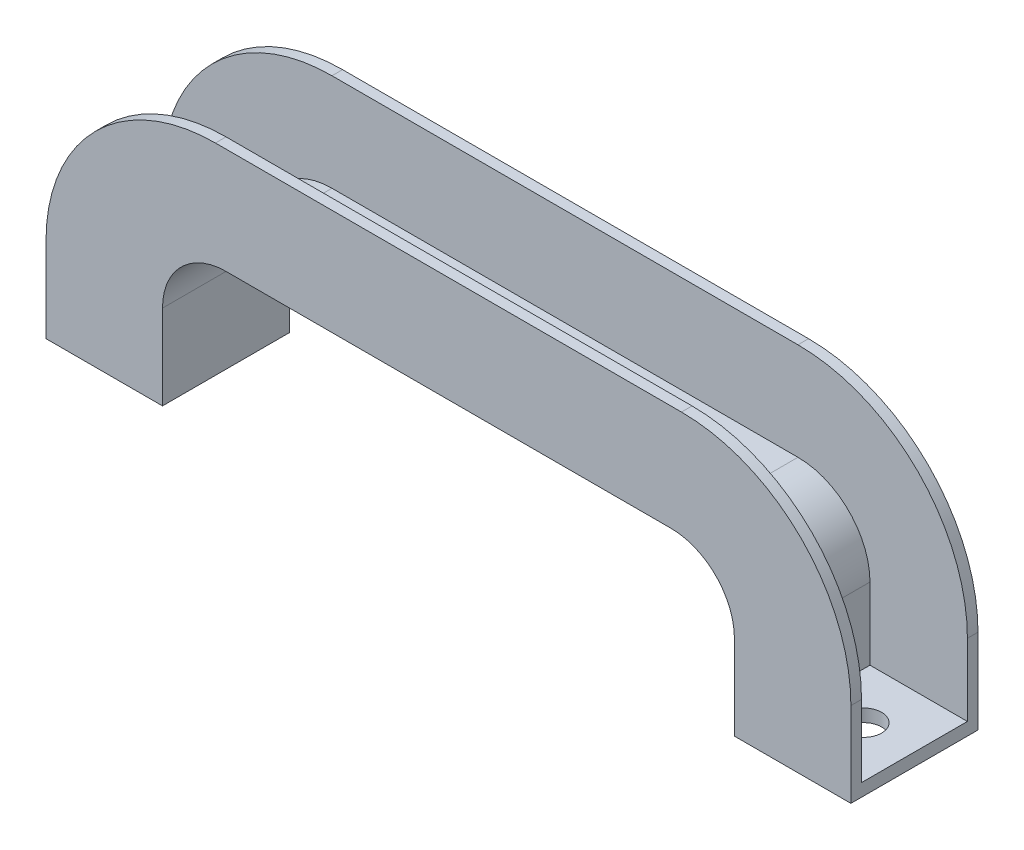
ISO-10303-21;
HEADER;
FILE_DESCRIPTION(('STEP AP214'),'2;1');
FILE_NAME('part.step','',(''),(''),'','','');
FILE_SCHEMA(('AUTOMOTIVE_DESIGN { 1 0 10303 214 1 1 1 1 }'));
ENDSEC;
DATA;
#1=APPLICATION_CONTEXT('core data for automotive mechanical design processes');
#2=APPLICATION_PROTOCOL_DEFINITION('international standard','automotive_design',2000,#1);
#3=PRODUCT_CONTEXT('',#1,'mechanical');
#4=PRODUCT('Part','Part','',(#3));
#5=PRODUCT_RELATED_PRODUCT_CATEGORY('part','',(#4));
#6=PRODUCT_DEFINITION_FORMATION('','',#4);
#7=PRODUCT_DEFINITION_CONTEXT('part definition',#1,'design');
#8=PRODUCT_DEFINITION('design','',#6,#7);
#9=PRODUCT_DEFINITION_SHAPE('','',#8);
#10=(LENGTH_UNIT() NAMED_UNIT(*) SI_UNIT(.MILLI.,.METRE.));
#11=(NAMED_UNIT(*) PLANE_ANGLE_UNIT() SI_UNIT($,.RADIAN.));
#12=(NAMED_UNIT(*) SI_UNIT($,.STERADIAN.) SOLID_ANGLE_UNIT());
#13=UNCERTAINTY_MEASURE_WITH_UNIT(LENGTH_MEASURE(1.E-05),#10,'distance_accuracy_value','');
#14=(GEOMETRIC_REPRESENTATION_CONTEXT(3) GLOBAL_UNCERTAINTY_ASSIGNED_CONTEXT((#13)) GLOBAL_UNIT_ASSIGNED_CONTEXT((#10,
#11,#12)) REPRESENTATION_CONTEXT('',''));
#15=CARTESIAN_POINT('',(0.,0.,0.));
#16=DIRECTION('',(0.,0.,1.));
#17=DIRECTION('',(1.,0.,0.));
#18=AXIS2_PLACEMENT_3D('',#15,#16,#17);
#19=CARTESIAN_POINT('',(190.,20.,15.));
#20=DIRECTION('',(-1.,0.,0.));
#21=DIRECTION('',(0.,-1.,0.));
#22=AXIS2_PLACEMENT_3D('',#19,#20,#21);
#23=PLANE('',#22);
#24=DIRECTION('',(0.,1.,0.));
#25=VECTOR('',#24,1.);
#26=CARTESIAN_POINT('',(190.,20.,-12.5));
#27=LINE('',#26,#25);
#28=CARTESIAN_POINT('',(190.,3.00000000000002,-12.5));
#29=VERTEX_POINT('',#28);
#30=CARTESIAN_POINT('',(190.,20.,-12.5));
#31=VERTEX_POINT('',#30);
#32=EDGE_CURVE('E281',#29,#31,#27,.T.);
#33=ORIENTED_EDGE('',*,*,#32,.F.);
#34=DIRECTION('',(0.,0.,1.));
#35=VECTOR('',#34,1.);
#36=CARTESIAN_POINT('',(190.,3.00000000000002,15.));
#37=LINE('',#36,#35);
#38=CARTESIAN_POINT('',(190.,3.00000000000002,12.5));
#39=VERTEX_POINT('',#38);
#40=EDGE_CURVE('E11',#29,#39,#37,.T.);
#41=ORIENTED_EDGE('',*,*,#40,.T.);
#42=DIRECTION('',(0.,1.,0.));
#43=VECTOR('',#42,1.);
#44=CARTESIAN_POINT('',(190.,20.,12.5));
#45=LINE('',#44,#43);
#46=CARTESIAN_POINT('',(190.,20.,12.5));
#47=VERTEX_POINT('',#46);
#48=EDGE_CURVE('E272',#39,#47,#45,.T.);
#49=ORIENTED_EDGE('',*,*,#48,.T.);
#50=DIRECTION('',(0.,0.,-1.));
#51=VECTOR('',#50,1.);
#52=CARTESIAN_POINT('',(190.,20.,15.));
#53=LINE('',#52,#51);
#54=CARTESIAN_POINT('',(190.,20.,15.));
#55=VERTEX_POINT('',#54);
#56=EDGE_CURVE('E351',#55,#47,#53,.T.);
#57=ORIENTED_EDGE('',*,*,#56,.F.);
#58=DIRECTION('',(0.,1.,0.));
#59=VECTOR('',#58,1.);
#60=CARTESIAN_POINT('',(190.,20.,15.));
#61=LINE('',#60,#59);
#62=CARTESIAN_POINT('',(190.,0.,15.));
#63=VERTEX_POINT('',#62);
#64=EDGE_CURVE('E326',#63,#55,#61,.T.);
#65=ORIENTED_EDGE('',*,*,#64,.F.);
#66=DIRECTION('',(0.,0.,-1.));
#67=VECTOR('',#66,1.);
#68=CARTESIAN_POINT('',(190.,0.,15.));
#69=LINE('',#68,#67);
#70=CARTESIAN_POINT('',(190.,0.,-15.));
#71=VERTEX_POINT('',#70);
#72=EDGE_CURVE('E354',#63,#71,#69,.T.);
#73=ORIENTED_EDGE('',*,*,#72,.T.);
#74=DIRECTION('',(0.,1.,0.));
#75=VECTOR('',#74,1.);
#76=CARTESIAN_POINT('',(190.,20.,-15.));
#77=LINE('',#76,#75);
#78=CARTESIAN_POINT('',(190.,20.,-15.));
#79=VERTEX_POINT('',#78);
#80=EDGE_CURVE('E298',#71,#79,#77,.T.);
#81=ORIENTED_EDGE('',*,*,#80,.T.);
#82=EDGE_CURVE('E350',#31,#79,#53,.T.);
#83=ORIENTED_EDGE('',*,*,#82,.F.);
#84=EDGE_LOOP('',(#33,#41,#49,#57,#65,#73,#81,#83));
#85=FACE_BOUND('',#84,.T.);
#86=ADVANCED_FACE('F33',(#85),#23,.F.);
#87=CARTESIAN_POINT('',(150.,20.,15.));
#88=DIRECTION('',(0.,0.,-1.));
#89=DIRECTION('',(-1.,0.,0.));
#90=AXIS2_PLACEMENT_3D('',#87,#88,#89);
#91=CYLINDRICAL_SURFACE('',#90,40.);
#92=CARTESIAN_POINT('',(150.,20.,-12.5));
#93=DIRECTION('',(0.,0.,1.));
#94=DIRECTION('',(1.,0.,0.));
#95=AXIS2_PLACEMENT_3D('',#92,#93,#94);
#96=CIRCLE('',#95,40.);
#97=CARTESIAN_POINT('',(150.,60.,-12.5));
#98=VERTEX_POINT('',#97);
#99=EDGE_CURVE('E279',#31,#98,#96,.T.);
#100=ORIENTED_EDGE('',*,*,#99,.F.);
#101=ORIENTED_EDGE('',*,*,#82,.T.);
#102=CARTESIAN_POINT('',(150.,20.,-15.));
#103=DIRECTION('',(0.,0.,1.));
#104=DIRECTION('',(-1.,0.,0.));
#105=AXIS2_PLACEMENT_3D('',#102,#103,#104);
#106=CIRCLE('',#105,40.);
#107=CARTESIAN_POINT('',(150.,60.,-15.));
#108=VERTEX_POINT('',#107);
#109=EDGE_CURVE('E301',#79,#108,#106,.T.);
#110=ORIENTED_EDGE('',*,*,#109,.T.);
#111=DIRECTION('',(0.,0.,-1.));
#112=VECTOR('',#111,1.);
#113=CARTESIAN_POINT('',(150.,60.,15.));
#114=LINE('',#113,#112);
#115=EDGE_CURVE('E346',#98,#108,#114,.T.);
#116=ORIENTED_EDGE('',*,*,#115,.F.);
#117=EDGE_LOOP('',(#100,#101,#110,#116));
#118=FACE_BOUND('',#117,.T.);
#119=ADVANCED_FACE('F420',(#118),#91,.T.);
#120=CARTESIAN_POINT('',(40.,60.,15.));
#121=DIRECTION('',(0.,-1.,0.));
#122=DIRECTION('',(1.,0.,0.));
#123=AXIS2_PLACEMENT_3D('',#120,#121,#122);
#124=PLANE('',#123);
#125=DIRECTION('',(-1.,0.,0.));
#126=VECTOR('',#125,1.);
#127=CARTESIAN_POINT('',(40.,60.,-12.5));
#128=LINE('',#127,#126);
#129=CARTESIAN_POINT('',(40.,60.,-12.5));
#130=VERTEX_POINT('',#129);
#131=EDGE_CURVE('E277',#98,#130,#128,.T.);
#132=ORIENTED_EDGE('',*,*,#131,.F.);
#133=ORIENTED_EDGE('',*,*,#115,.T.);
#134=DIRECTION('',(-1.,0.,0.));
#135=VECTOR('',#134,1.);
#136=CARTESIAN_POINT('',(40.,60.,-15.));
#137=LINE('',#136,#135);
#138=CARTESIAN_POINT('',(40.,60.,-15.));
#139=VERTEX_POINT('',#138);
#140=EDGE_CURVE('E304',#108,#139,#137,.T.);
#141=ORIENTED_EDGE('',*,*,#140,.T.);
#142=DIRECTION('',(0.,0.,-1.));
#143=VECTOR('',#142,1.);
#144=CARTESIAN_POINT('',(40.,60.,15.));
#145=LINE('',#144,#143);
#146=EDGE_CURVE('E342',#130,#139,#145,.T.);
#147=ORIENTED_EDGE('',*,*,#146,.F.);
#148=EDGE_LOOP('',(#132,#133,#141,#147));
#149=FACE_BOUND('',#148,.T.);
#150=ADVANCED_FACE('F486',(#149),#124,.F.);
#151=CARTESIAN_POINT('',(40.,20.,15.));
#152=DIRECTION('',(0.,0.,-1.));
#153=DIRECTION('',(-1.,0.,0.));
#154=AXIS2_PLACEMENT_3D('',#151,#152,#153);
#155=CYLINDRICAL_SURFACE('',#154,40.);
#156=CARTESIAN_POINT('',(40.,20.,-12.5));
#157=DIRECTION('',(0.,0.,1.));
#158=DIRECTION('',(1.,0.,0.));
#159=AXIS2_PLACEMENT_3D('',#156,#157,#158);
#160=CIRCLE('',#159,40.);
#161=CARTESIAN_POINT('',(0.,20.,-12.5));
#162=VERTEX_POINT('',#161);
#163=EDGE_CURVE('E275',#130,#162,#160,.T.);
#164=ORIENTED_EDGE('',*,*,#163,.F.);
#165=ORIENTED_EDGE('',*,*,#146,.T.);
#166=CARTESIAN_POINT('',(40.,20.,-15.));
#167=DIRECTION('',(0.,0.,1.));
#168=DIRECTION('',(-1.,0.,0.));
#169=AXIS2_PLACEMENT_3D('',#166,#167,#168);
#170=CIRCLE('',#169,40.);
#171=CARTESIAN_POINT('',(0.,20.,-15.));
#172=VERTEX_POINT('',#171);
#173=EDGE_CURVE('E307',#139,#172,#170,.T.);
#174=ORIENTED_EDGE('',*,*,#173,.T.);
#175=DIRECTION('',(0.,0.,-1.));
#176=VECTOR('',#175,1.);
#177=CARTESIAN_POINT('',(0.,20.,15.));
#178=LINE('',#177,#176);
#179=EDGE_CURVE('E338',#162,#172,#178,.T.);
#180=ORIENTED_EDGE('',*,*,#179,.F.);
#181=EDGE_LOOP('',(#164,#165,#174,#180));
#182=FACE_BOUND('',#181,.T.);
#183=ADVANCED_FACE('F483',(#182),#155,.T.);
#184=CARTESIAN_POINT('',(0.,0.,15.));
#185=DIRECTION('',(1.,0.,0.));
#186=DIRECTION('',(0.,0.,-1.));
#187=AXIS2_PLACEMENT_3D('',#184,#185,#186);
#188=PLANE('',#187);
#189=DIRECTION('',(0.,-1.,0.));
#190=VECTOR('',#189,1.);
#191=CARTESIAN_POINT('',(0.,0.,-12.5));
#192=LINE('',#191,#190);
#193=CARTESIAN_POINT('',(0.,3.,-12.5));
#194=VERTEX_POINT('',#193);
#195=EDGE_CURVE('E42',#162,#194,#192,.T.);
#196=ORIENTED_EDGE('',*,*,#195,.F.);
#197=ORIENTED_EDGE('',*,*,#179,.T.);
#198=DIRECTION('',(0.,-1.,0.));
#199=VECTOR('',#198,1.);
#200=CARTESIAN_POINT('',(0.,0.,-15.));
#201=LINE('',#200,#199);
#202=CARTESIAN_POINT('',(0.,0.,-15.));
#203=VERTEX_POINT('',#202);
#204=EDGE_CURVE('E310',#172,#203,#201,.T.);
#205=ORIENTED_EDGE('',*,*,#204,.T.);
#206=DIRECTION('',(0.,0.,-1.));
#207=VECTOR('',#206,1.);
#208=CARTESIAN_POINT('',(0.,0.,15.));
#209=LINE('',#208,#207);
#210=CARTESIAN_POINT('',(0.,0.,15.));
#211=VERTEX_POINT('',#210);
#212=EDGE_CURVE('E335',#211,#203,#209,.T.);
#213=ORIENTED_EDGE('',*,*,#212,.F.);
#214=DIRECTION('',(0.,-1.,0.));
#215=VECTOR('',#214,1.);
#216=CARTESIAN_POINT('',(0.,0.,15.));
#217=LINE('',#216,#215);
#218=CARTESIAN_POINT('',(0.,20.,15.));
#219=VERTEX_POINT('',#218);
#220=EDGE_CURVE('E58',#219,#211,#217,.T.);
#221=ORIENTED_EDGE('',*,*,#220,.F.);
#222=CARTESIAN_POINT('',(0.,20.,12.5));
#223=VERTEX_POINT('',#222);
#224=EDGE_CURVE('E339',#219,#223,#178,.T.);
#225=ORIENTED_EDGE('',*,*,#224,.T.);
#226=DIRECTION('',(0.,-1.,0.));
#227=VECTOR('',#226,1.);
#228=CARTESIAN_POINT('',(0.,0.,12.5));
#229=LINE('',#228,#227);
#230=CARTESIAN_POINT('',(0.,2.99999999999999,12.5));
#231=VERTEX_POINT('',#230);
#232=EDGE_CURVE('E375',#223,#231,#229,.T.);
#233=ORIENTED_EDGE('',*,*,#232,.T.);
#234=DIRECTION('',(0.,0.,-1.));
#235=VECTOR('',#234,1.);
#236=CARTESIAN_POINT('',(0.,3.,15.));
#237=LINE('',#236,#235);
#238=EDGE_CURVE('E202',#231,#194,#237,.T.);
#239=ORIENTED_EDGE('',*,*,#238,.T.);
#240=EDGE_LOOP('',(#196,#197,#205,#213,#221,#225,#233,#239));
#241=FACE_BOUND('',#240,.T.);
#242=ADVANCED_FACE('F443',(#241),#188,.F.);
#243=CARTESIAN_POINT('',(27.5,0.,15.));
#244=DIRECTION('',(0.,1.,0.));
#245=DIRECTION('',(0.,0.,1.));
#246=AXIS2_PLACEMENT_3D('',#243,#244,#245);
#247=PLANE('',#246);
#248=CARTESIAN_POINT('',(12.,0.,0.));
#249=DIRECTION('',(0.,-1.,0.));
#250=DIRECTION('',(0.,0.,-1.));
#251=AXIS2_PLACEMENT_3D('',#248,#249,#250);
#252=CIRCLE('',#251,4.25);
#253=CARTESIAN_POINT('',(12.,0.,-4.25));
#254=VERTEX_POINT('',#253);
#255=EDGE_CURVE('E379',#254,#254,#252,.T.);
#256=ORIENTED_EDGE('',*,*,#255,.F.);
#257=EDGE_LOOP('',(#256));
#258=FACE_BOUND('',#257,.T.);
#259=DIRECTION('',(1.,0.,0.));
#260=VECTOR('',#259,1.);
#261=CARTESIAN_POINT('',(27.5,0.,-15.));
#262=LINE('',#261,#260);
#263=CARTESIAN_POINT('',(27.5,0.,-15.));
#264=VERTEX_POINT('',#263);
#265=EDGE_CURVE('E283',#203,#264,#262,.T.);
#266=ORIENTED_EDGE('',*,*,#265,.T.);
#267=DIRECTION('',(0.,0.,-1.));
#268=VECTOR('',#267,1.);
#269=CARTESIAN_POINT('',(27.5,0.,15.));
#270=LINE('',#269,#268);
#271=CARTESIAN_POINT('',(27.5,0.,15.));
#272=VERTEX_POINT('',#271);
#273=EDGE_CURVE('E372',#272,#264,#270,.T.);
#274=ORIENTED_EDGE('',*,*,#273,.F.);
#275=DIRECTION('',(1.,0.,0.));
#276=VECTOR('',#275,1.);
#277=CARTESIAN_POINT('',(27.5,0.,15.));
#278=LINE('',#277,#276);
#279=EDGE_CURVE('E312',#211,#272,#278,.T.);
#280=ORIENTED_EDGE('',*,*,#279,.F.);
#281=ORIENTED_EDGE('',*,*,#212,.T.);
#282=EDGE_LOOP('',(#266,#274,#280,#281));
#283=FACE_BOUND('',#282,.T.);
#284=ADVANCED_FACE('F35',(#258,#283),#247,.F.);
#285=CARTESIAN_POINT('',(27.5,20.,15.));
#286=DIRECTION('',(-1.,0.,0.));
#287=DIRECTION('',(0.,0.,1.));
#288=AXIS2_PLACEMENT_3D('',#285,#286,#287);
#289=PLANE('',#288);
#290=DIRECTION('',(0.,1.,0.));
#291=VECTOR('',#290,1.);
#292=CARTESIAN_POINT('',(27.5,20.,-15.));
#293=LINE('',#292,#291);
#294=CARTESIAN_POINT('',(27.5,20.,-15.));
#295=VERTEX_POINT('',#294);
#296=EDGE_CURVE('E286',#264,#295,#293,.T.);
#297=ORIENTED_EDGE('',*,*,#296,.T.);
#298=DIRECTION('',(0.,0.,-1.));
#299=VECTOR('',#298,1.);
#300=CARTESIAN_POINT('',(27.5,20.,15.));
#301=LINE('',#300,#299);
#302=CARTESIAN_POINT('',(27.5,20.,15.));
#303=VERTEX_POINT('',#302);
#304=EDGE_CURVE('E369',#303,#295,#301,.T.);
#305=ORIENTED_EDGE('',*,*,#304,.F.);
#306=DIRECTION('',(0.,1.,0.));
#307=VECTOR('',#306,1.);
#308=CARTESIAN_POINT('',(27.5,20.,15.));
#309=LINE('',#308,#307);
#310=EDGE_CURVE('E314',#272,#303,#309,.T.);
#311=ORIENTED_EDGE('',*,*,#310,.F.);
#312=ORIENTED_EDGE('',*,*,#273,.T.);
#313=EDGE_LOOP('',(#297,#305,#311,#312));
#314=FACE_BOUND('',#313,.T.);
#315=ADVANCED_FACE('F478',(#314),#289,.F.);
#316=CARTESIAN_POINT('',(42.5,20.,15.));
#317=DIRECTION('',(0.,0.,-1.));
#318=DIRECTION('',(-1.,0.,0.));
#319=AXIS2_PLACEMENT_3D('',#316,#317,#318);
#320=CYLINDRICAL_SURFACE('',#319,15.);
#321=CARTESIAN_POINT('',(42.5,20.,-15.));
#322=DIRECTION('',(0.,0.,-1.));
#323=DIRECTION('',(1.,0.,0.));
#324=AXIS2_PLACEMENT_3D('',#321,#322,#323);
#325=CIRCLE('',#324,15.);
#326=CARTESIAN_POINT('',(42.5,35.,-15.));
#327=VERTEX_POINT('',#326);
#328=EDGE_CURVE('E288',#295,#327,#325,.T.);
#329=ORIENTED_EDGE('',*,*,#328,.T.);
#330=DIRECTION('',(0.,0.,-1.));
#331=VECTOR('',#330,1.);
#332=CARTESIAN_POINT('',(42.5,35.,15.));
#333=LINE('',#332,#331);
#334=CARTESIAN_POINT('',(42.5,35.,15.));
#335=VERTEX_POINT('',#334);
#336=EDGE_CURVE('E366',#335,#327,#333,.T.);
#337=ORIENTED_EDGE('',*,*,#336,.F.);
#338=CARTESIAN_POINT('',(42.5,20.,15.));
#339=DIRECTION('',(0.,0.,-1.));
#340=DIRECTION('',(1.,0.,0.));
#341=AXIS2_PLACEMENT_3D('',#338,#339,#340);
#342=CIRCLE('',#341,15.);
#343=EDGE_CURVE('E316',#303,#335,#342,.T.);
#344=ORIENTED_EDGE('',*,*,#343,.F.);
#345=ORIENTED_EDGE('',*,*,#304,.T.);
#346=EDGE_LOOP('',(#329,#337,#344,#345));
#347=FACE_BOUND('',#346,.T.);
#348=ADVANCED_FACE('F473',(#347),#320,.F.);
#349=CARTESIAN_POINT('',(147.5,35.,15.));
#350=DIRECTION('',(0.,1.,0.));
#351=DIRECTION('',(-1.,0.,0.));
#352=AXIS2_PLACEMENT_3D('',#349,#350,#351);
#353=PLANE('',#352);
#354=DIRECTION('',(1.,0.,0.));
#355=VECTOR('',#354,1.);
#356=CARTESIAN_POINT('',(147.5,35.,-15.));
#357=LINE('',#356,#355);
#358=CARTESIAN_POINT('',(147.5,35.,-15.));
#359=VERTEX_POINT('',#358);
#360=EDGE_CURVE('E290',#327,#359,#357,.T.);
#361=ORIENTED_EDGE('',*,*,#360,.T.);
#362=DIRECTION('',(0.,0.,-1.));
#363=VECTOR('',#362,1.);
#364=CARTESIAN_POINT('',(147.5,35.,15.));
#365=LINE('',#364,#363);
#366=CARTESIAN_POINT('',(147.5,35.,15.));
#367=VERTEX_POINT('',#366);
#368=EDGE_CURVE('E363',#367,#359,#365,.T.);
#369=ORIENTED_EDGE('',*,*,#368,.F.);
#370=DIRECTION('',(1.,0.,0.));
#371=VECTOR('',#370,1.);
#372=CARTESIAN_POINT('',(147.5,35.,15.));
#373=LINE('',#372,#371);
#374=EDGE_CURVE('E318',#335,#367,#373,.T.);
#375=ORIENTED_EDGE('',*,*,#374,.F.);
#376=ORIENTED_EDGE('',*,*,#336,.T.);
#377=EDGE_LOOP('',(#361,#369,#375,#376));
#378=FACE_BOUND('',#377,.T.);
#379=ADVANCED_FACE('F469',(#378),#353,.F.);
#380=CARTESIAN_POINT('',(147.5,20.,15.));
#381=DIRECTION('',(0.,0.,-1.));
#382=DIRECTION('',(-1.,0.,0.));
#383=AXIS2_PLACEMENT_3D('',#380,#381,#382);
#384=CYLINDRICAL_SURFACE('',#383,15.);
#385=CARTESIAN_POINT('',(147.5,20.,-15.));
#386=DIRECTION('',(0.,0.,-1.));
#387=DIRECTION('',(1.,0.,0.));
#388=AXIS2_PLACEMENT_3D('',#385,#386,#387);
#389=CIRCLE('',#388,15.);
#390=CARTESIAN_POINT('',(162.5,20.,-15.));
#391=VERTEX_POINT('',#390);
#392=EDGE_CURVE('E292',#359,#391,#389,.T.);
#393=ORIENTED_EDGE('',*,*,#392,.T.);
#394=DIRECTION('',(0.,0.,-1.));
#395=VECTOR('',#394,1.);
#396=CARTESIAN_POINT('',(162.5,20.,15.));
#397=LINE('',#396,#395);
#398=CARTESIAN_POINT('',(162.5,20.,15.));
#399=VERTEX_POINT('',#398);
#400=EDGE_CURVE('E360',#399,#391,#397,.T.);
#401=ORIENTED_EDGE('',*,*,#400,.F.);
#402=CARTESIAN_POINT('',(147.5,20.,15.));
#403=DIRECTION('',(0.,0.,-1.));
#404=DIRECTION('',(1.,0.,0.));
#405=AXIS2_PLACEMENT_3D('',#402,#403,#404);
#406=CIRCLE('',#405,15.);
#407=EDGE_CURVE('E320',#367,#399,#406,.T.);
#408=ORIENTED_EDGE('',*,*,#407,.F.);
#409=ORIENTED_EDGE('',*,*,#368,.T.);
#410=EDGE_LOOP('',(#393,#401,#408,#409));
#411=FACE_BOUND('',#410,.T.);
#412=ADVANCED_FACE('F465',(#411),#384,.F.);
#413=CARTESIAN_POINT('',(162.5,0.,15.));
#414=DIRECTION('',(1.,0.,0.));
#415=DIRECTION('',(0.,1.,0.));
#416=AXIS2_PLACEMENT_3D('',#413,#414,#415);
#417=PLANE('',#416);
#418=DIRECTION('',(0.,-1.,0.));
#419=VECTOR('',#418,1.);
#420=CARTESIAN_POINT('',(162.5,0.,-15.));
#421=LINE('',#420,#419);
#422=CARTESIAN_POINT('',(162.5,0.,-15.));
#423=VERTEX_POINT('',#422);
#424=EDGE_CURVE('E294',#391,#423,#421,.T.);
#425=ORIENTED_EDGE('',*,*,#424,.T.);
#426=DIRECTION('',(0.,0.,-1.));
#427=VECTOR('',#426,1.);
#428=CARTESIAN_POINT('',(162.5,0.,15.));
#429=LINE('',#428,#427);
#430=CARTESIAN_POINT('',(162.5,0.,15.));
#431=VERTEX_POINT('',#430);
#432=EDGE_CURVE('E357',#431,#423,#429,.T.);
#433=ORIENTED_EDGE('',*,*,#432,.F.);
#434=DIRECTION('',(0.,-1.,0.));
#435=VECTOR('',#434,1.);
#436=CARTESIAN_POINT('',(162.5,0.,15.));
#437=LINE('',#436,#435);
#438=EDGE_CURVE('E322',#399,#431,#437,.T.);
#439=ORIENTED_EDGE('',*,*,#438,.F.);
#440=ORIENTED_EDGE('',*,*,#400,.T.);
#441=EDGE_LOOP('',(#425,#433,#439,#440));
#442=FACE_BOUND('',#441,.T.);
#443=ADVANCED_FACE('F398',(#442),#417,.F.);
#444=CARTESIAN_POINT('',(190.,0.,15.));
#445=DIRECTION('',(0.,1.,0.));
#446=DIRECTION('',(0.,0.,1.));
#447=AXIS2_PLACEMENT_3D('',#444,#445,#446);
#448=PLANE('',#447);
#449=CARTESIAN_POINT('',(178.,0.,0.));
#450=DIRECTION('',(0.,-1.,0.));
#451=DIRECTION('',(0.,0.,-1.));
#452=AXIS2_PLACEMENT_3D('',#449,#450,#451);
#453=CIRCLE('',#452,4.25000000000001);
#454=CARTESIAN_POINT('',(178.,0.,-4.25000000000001));
#455=VERTEX_POINT('',#454);
#456=EDGE_CURVE('E386',#455,#455,#453,.T.);
#457=ORIENTED_EDGE('',*,*,#456,.F.);
#458=EDGE_LOOP('',(#457));
#459=FACE_BOUND('',#458,.T.);
#460=DIRECTION('',(1.,0.,0.));
#461=VECTOR('',#460,1.);
#462=CARTESIAN_POINT('',(190.,0.,-15.));
#463=LINE('',#462,#461);
#464=EDGE_CURVE('E296',#423,#71,#463,.T.);
#465=ORIENTED_EDGE('',*,*,#464,.T.);
#466=ORIENTED_EDGE('',*,*,#72,.F.);
#467=DIRECTION('',(1.,0.,0.));
#468=VECTOR('',#467,1.);
#469=CARTESIAN_POINT('',(190.,0.,15.));
#470=LINE('',#469,#468);
#471=EDGE_CURVE('E324',#431,#63,#470,.T.);
#472=ORIENTED_EDGE('',*,*,#471,.F.);
#473=ORIENTED_EDGE('',*,*,#432,.T.);
#474=EDGE_LOOP('',(#465,#466,#472,#473));
#475=FACE_BOUND('',#474,.T.);
#476=ADVANCED_FACE('F394',(#459,#475),#448,.F.);
#477=ORIENTED_EDGE('',*,*,#56,.T.);
#478=CARTESIAN_POINT('',(150.,20.,12.5));
#479=DIRECTION('',(0.,0.,1.));
#480=DIRECTION('',(1.,0.,0.));
#481=AXIS2_PLACEMENT_3D('',#478,#479,#480);
#482=CIRCLE('',#481,40.);
#483=CARTESIAN_POINT('',(150.,60.,12.5));
#484=VERTEX_POINT('',#483);
#485=EDGE_CURVE('E269',#47,#484,#482,.T.);
#486=ORIENTED_EDGE('',*,*,#485,.T.);
#487=CARTESIAN_POINT('',(150.,60.,15.));
#488=VERTEX_POINT('',#487);
#489=EDGE_CURVE('E347',#488,#484,#114,.T.);
#490=ORIENTED_EDGE('',*,*,#489,.F.);
#491=CARTESIAN_POINT('',(150.,20.,15.));
#492=DIRECTION('',(0.,0.,1.));
#493=DIRECTION('',(-1.,0.,0.));
#494=AXIS2_PLACEMENT_3D('',#491,#492,#493);
#495=CIRCLE('',#494,40.);
#496=EDGE_CURVE('E328',#55,#488,#495,.T.);
#497=ORIENTED_EDGE('',*,*,#496,.F.);
#498=EDGE_LOOP('',(#477,#486,#490,#497));
#499=FACE_BOUND('',#498,.T.);
#500=ADVANCED_FACE('F397',(#499),#91,.T.);
#501=ORIENTED_EDGE('',*,*,#489,.T.);
#502=DIRECTION('',(-1.,0.,0.));
#503=VECTOR('',#502,1.);
#504=CARTESIAN_POINT('',(40.,60.,12.5));
#505=LINE('',#504,#503);
#506=CARTESIAN_POINT('',(40.,60.,12.5));
#507=VERTEX_POINT('',#506);
#508=EDGE_CURVE('E266',#484,#507,#505,.T.);
#509=ORIENTED_EDGE('',*,*,#508,.T.);
#510=CARTESIAN_POINT('',(40.,60.,15.));
#511=VERTEX_POINT('',#510);
#512=EDGE_CURVE('E343',#511,#507,#145,.T.);
#513=ORIENTED_EDGE('',*,*,#512,.F.);
#514=DIRECTION('',(-1.,0.,0.));
#515=VECTOR('',#514,1.);
#516=CARTESIAN_POINT('',(40.,60.,15.));
#517=LINE('',#516,#515);
#518=EDGE_CURVE('E330',#488,#511,#517,.T.);
#519=ORIENTED_EDGE('',*,*,#518,.F.);
#520=EDGE_LOOP('',(#501,#509,#513,#519));
#521=FACE_BOUND('',#520,.T.);
#522=ADVANCED_FACE('F452',(#521),#124,.F.);
#523=ORIENTED_EDGE('',*,*,#512,.T.);
#524=CARTESIAN_POINT('',(40.,20.,12.5));
#525=DIRECTION('',(0.,0.,1.));
#526=DIRECTION('',(1.,0.,0.));
#527=AXIS2_PLACEMENT_3D('',#524,#525,#526);
#528=CIRCLE('',#527,40.);
#529=EDGE_CURVE('E256',#507,#223,#528,.T.);
#530=ORIENTED_EDGE('',*,*,#529,.T.);
#531=ORIENTED_EDGE('',*,*,#224,.F.);
#532=CARTESIAN_POINT('',(40.,20.,15.));
#533=DIRECTION('',(0.,0.,1.));
#534=DIRECTION('',(-1.,0.,0.));
#535=AXIS2_PLACEMENT_3D('',#532,#533,#534);
#536=CIRCLE('',#535,40.);
#537=EDGE_CURVE('E332',#511,#219,#536,.T.);
#538=ORIENTED_EDGE('',*,*,#537,.F.);
#539=EDGE_LOOP('',(#523,#530,#531,#538));
#540=FACE_BOUND('',#539,.T.);
#541=ADVANCED_FACE('F447',(#540),#155,.T.);
#542=CARTESIAN_POINT('',(40.,20.,15.));
#543=DIRECTION('',(0.,0.,-1.));
#544=DIRECTION('',(-1.,0.,0.));
#545=AXIS2_PLACEMENT_3D('',#542,#543,#544);
#546=PLANE('',#545);
#547=ORIENTED_EDGE('',*,*,#279,.T.);
#548=ORIENTED_EDGE('',*,*,#310,.T.);
#549=ORIENTED_EDGE('',*,*,#343,.T.);
#550=ORIENTED_EDGE('',*,*,#374,.T.);
#551=ORIENTED_EDGE('',*,*,#407,.T.);
#552=ORIENTED_EDGE('',*,*,#438,.T.);
#553=ORIENTED_EDGE('',*,*,#471,.T.);
#554=ORIENTED_EDGE('',*,*,#64,.T.);
#555=ORIENTED_EDGE('',*,*,#496,.T.);
#556=ORIENTED_EDGE('',*,*,#518,.T.);
#557=ORIENTED_EDGE('',*,*,#537,.T.);
#558=ORIENTED_EDGE('',*,*,#220,.T.);
#559=EDGE_LOOP('',(#547,#548,#549,#550,#551,#552,#553,#554,#555,#556,#557,#558));
#560=FACE_BOUND('',#559,.T.);
#561=ADVANCED_FACE('F456',(#560),#546,.F.);
#562=CARTESIAN_POINT('',(40.,20.,-15.));
#563=DIRECTION('',(0.,0.,-1.));
#564=DIRECTION('',(-1.,0.,0.));
#565=AXIS2_PLACEMENT_3D('',#562,#563,#564);
#566=PLANE('',#565);
#567=ORIENTED_EDGE('',*,*,#265,.F.);
#568=ORIENTED_EDGE('',*,*,#204,.F.);
#569=ORIENTED_EDGE('',*,*,#173,.F.);
#570=ORIENTED_EDGE('',*,*,#140,.F.);
#571=ORIENTED_EDGE('',*,*,#109,.F.);
#572=ORIENTED_EDGE('',*,*,#80,.F.);
#573=ORIENTED_EDGE('',*,*,#464,.F.);
#574=ORIENTED_EDGE('',*,*,#424,.F.);
#575=ORIENTED_EDGE('',*,*,#392,.F.);
#576=ORIENTED_EDGE('',*,*,#360,.F.);
#577=ORIENTED_EDGE('',*,*,#328,.F.);
#578=ORIENTED_EDGE('',*,*,#296,.F.);
#579=EDGE_LOOP('',(#567,#568,#569,#570,#571,#572,#573,#574,#575,#576,#577,#578));
#580=FACE_BOUND('',#579,.T.);
#581=ADVANCED_FACE('F414',(#580),#566,.T.);
#582=CARTESIAN_POINT('',(209.647037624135,3.00000000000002,-12.5));
#583=DIRECTION('',(0.,-1.,0.));
#584=DIRECTION('',(1.,0.,0.));
#585=AXIS2_PLACEMENT_3D('',#582,#583,#584);
#586=PLANE('',#585);
#587=CARTESIAN_POINT('',(178.,3.00000000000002,0.));
#588=DIRECTION('',(0.,-1.,0.));
#589=DIRECTION('',(1.,0.,0.));
#590=AXIS2_PLACEMENT_3D('',#587,#588,#589);
#591=CIRCLE('',#590,4.25000000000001);
#592=CARTESIAN_POINT('',(182.25,3.00000000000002,0.));
#593=VERTEX_POINT('',#592);
#594=EDGE_CURVE('E37',#593,#593,#591,.T.);
#595=ORIENTED_EDGE('',*,*,#594,.T.);
#596=EDGE_LOOP('',(#595));
#597=FACE_BOUND('',#596,.T.);
#598=DIRECTION('',(1.,0.,0.));
#599=VECTOR('',#598,1.);
#600=CARTESIAN_POINT('',(209.647037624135,3.00000000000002,-12.5));
#601=LINE('',#600,#599);
#602=CARTESIAN_POINT('',(167.,3.00000000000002,-12.5));
#603=VERTEX_POINT('',#602);
#604=EDGE_CURVE('E213',#603,#29,#601,.T.);
#605=ORIENTED_EDGE('',*,*,#604,.F.);
#606=DIRECTION('',(0.,0.,1.));
#607=VECTOR('',#606,1.);
#608=CARTESIAN_POINT('',(167.,3.00000000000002,-12.5));
#609=LINE('',#608,#607);
#610=CARTESIAN_POINT('',(167.,3.00000000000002,12.5));
#611=VERTEX_POINT('',#610);
#612=EDGE_CURVE('E254',#603,#611,#609,.T.);
#613=ORIENTED_EDGE('',*,*,#612,.T.);
#614=DIRECTION('',(1.,0.,0.));
#615=VECTOR('',#614,1.);
#616=CARTESIAN_POINT('',(209.647037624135,3.00000000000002,12.5));
#617=LINE('',#616,#615);
#618=EDGE_CURVE('E234',#611,#39,#617,.T.);
#619=ORIENTED_EDGE('',*,*,#618,.T.);
#620=ORIENTED_EDGE('',*,*,#40,.F.);
#621=EDGE_LOOP('',(#605,#613,#619,#620));
#622=FACE_BOUND('',#621,.T.);
#623=ADVANCED_FACE('F427',(#597,#622),#586,.F.);
#624=CARTESIAN_POINT('',(23.,3.,-12.5));
#625=DIRECTION('',(0.,-1.,0.));
#626=DIRECTION('',(1.,0.,0.));
#627=AXIS2_PLACEMENT_3D('',#624,#625,#626);
#628=PLANE('',#627);
#629=CARTESIAN_POINT('',(12.,3.,0.));
#630=DIRECTION('',(0.,-1.,0.));
#631=DIRECTION('',(1.,0.,0.));
#632=AXIS2_PLACEMENT_3D('',#629,#630,#631);
#633=CIRCLE('',#632,4.25);
#634=CARTESIAN_POINT('',(16.25,3.,0.));
#635=VERTEX_POINT('',#634);
#636=EDGE_CURVE('E205',#635,#635,#633,.T.);
#637=ORIENTED_EDGE('',*,*,#636,.T.);
#638=EDGE_LOOP('',(#637));
#639=FACE_BOUND('',#638,.T.);
#640=DIRECTION('',(1.,0.,0.));
#641=VECTOR('',#640,1.);
#642=CARTESIAN_POINT('',(23.,3.,12.5));
#643=LINE('',#642,#641);
#644=CARTESIAN_POINT('',(23.,3.,12.5));
#645=VERTEX_POINT('',#644);
#646=EDGE_CURVE('E50',#231,#645,#643,.T.);
#647=ORIENTED_EDGE('',*,*,#646,.T.);
#648=DIRECTION('',(0.,0.,1.));
#649=VECTOR('',#648,1.);
#650=CARTESIAN_POINT('',(23.,3.,-12.5));
#651=LINE('',#650,#649);
#652=CARTESIAN_POINT('',(23.,3.,-12.5));
#653=VERTEX_POINT('',#652);
#654=EDGE_CURVE('E199',#653,#645,#651,.T.);
#655=ORIENTED_EDGE('',*,*,#654,.F.);
#656=DIRECTION('',(1.,0.,0.));
#657=VECTOR('',#656,1.);
#658=CARTESIAN_POINT('',(23.,3.,-12.5));
#659=LINE('',#658,#657);
#660=EDGE_CURVE('E237',#194,#653,#659,.T.);
#661=ORIENTED_EDGE('',*,*,#660,.F.);
#662=ORIENTED_EDGE('',*,*,#238,.F.);
#663=EDGE_LOOP('',(#647,#655,#661,#662));
#664=FACE_BOUND('',#663,.T.);
#665=ADVANCED_FACE('F197',(#639,#664),#628,.F.);
#666=CARTESIAN_POINT('',(150.,20.,-12.5));
#667=DIRECTION('',(0.,0.,1.));
#668=DIRECTION('',(1.,0.,0.));
#669=AXIS2_PLACEMENT_3D('',#666,#667,#668);
#670=PLANE('',#669);
#671=ORIENTED_EDGE('',*,*,#32,.T.);
#672=ORIENTED_EDGE('',*,*,#99,.T.);
#673=ORIENTED_EDGE('',*,*,#131,.T.);
#674=ORIENTED_EDGE('',*,*,#163,.T.);
#675=ORIENTED_EDGE('',*,*,#195,.T.);
#676=ORIENTED_EDGE('',*,*,#660,.T.);
#677=DIRECTION('',(0.,1.,0.));
#678=VECTOR('',#677,1.);
#679=CARTESIAN_POINT('',(23.,20.,-12.5));
#680=LINE('',#679,#678);
#681=CARTESIAN_POINT('',(23.,20.,-12.5));
#682=VERTEX_POINT('',#681);
#683=EDGE_CURVE('E211',#653,#682,#680,.T.);
#684=ORIENTED_EDGE('',*,*,#683,.T.);
#685=CARTESIAN_POINT('',(40.,20.,-12.5));
#686=DIRECTION('',(0.,0.,-1.));
#687=DIRECTION('',(1.,0.,0.));
#688=AXIS2_PLACEMENT_3D('',#685,#686,#687);
#689=CIRCLE('',#688,17.);
#690=CARTESIAN_POINT('',(40.,37.,-12.5));
#691=VERTEX_POINT('',#690);
#692=EDGE_CURVE('E240',#682,#691,#689,.T.);
#693=ORIENTED_EDGE('',*,*,#692,.T.);
#694=DIRECTION('',(1.,0.,0.));
#695=VECTOR('',#694,1.);
#696=CARTESIAN_POINT('',(150.,37.,-12.5));
#697=LINE('',#696,#695);
#698=CARTESIAN_POINT('',(150.,37.,-12.5));
#699=VERTEX_POINT('',#698);
#700=EDGE_CURVE('E243',#691,#699,#697,.T.);
#701=ORIENTED_EDGE('',*,*,#700,.T.);
#702=CARTESIAN_POINT('',(150.,20.,-12.5));
#703=DIRECTION('',(0.,0.,-1.));
#704=DIRECTION('',(1.,0.,0.));
#705=AXIS2_PLACEMENT_3D('',#702,#703,#704);
#706=CIRCLE('',#705,17.);
#707=CARTESIAN_POINT('',(167.,20.,-12.5));
#708=VERTEX_POINT('',#707);
#709=EDGE_CURVE('E246',#699,#708,#706,.T.);
#710=ORIENTED_EDGE('',*,*,#709,.T.);
#711=DIRECTION('',(0.,-1.,0.));
#712=VECTOR('',#711,1.);
#713=CARTESIAN_POINT('',(167.,3.00000000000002,-12.5));
#714=LINE('',#713,#712);
#715=EDGE_CURVE('E249',#708,#603,#714,.T.);
#716=ORIENTED_EDGE('',*,*,#715,.T.);
#717=ORIENTED_EDGE('',*,*,#604,.T.);
#718=EDGE_LOOP('',(#671,#672,#673,#674,#675,#676,#684,#693,#701,#710,#716,#717));
#719=FACE_BOUND('',#718,.T.);
#720=ADVANCED_FACE('F422',(#719),#670,.T.);
#721=CARTESIAN_POINT('',(150.,20.,12.5));
#722=DIRECTION('',(0.,0.,1.));
#723=DIRECTION('',(1.,0.,0.));
#724=AXIS2_PLACEMENT_3D('',#721,#722,#723);
#725=PLANE('',#724);
#726=ORIENTED_EDGE('',*,*,#618,.F.);
#727=DIRECTION('',(0.,-1.,0.));
#728=VECTOR('',#727,1.);
#729=CARTESIAN_POINT('',(167.,3.00000000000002,12.5));
#730=LINE('',#729,#728);
#731=CARTESIAN_POINT('',(167.,20.,12.5));
#732=VERTEX_POINT('',#731);
#733=EDGE_CURVE('E231',#732,#611,#730,.T.);
#734=ORIENTED_EDGE('',*,*,#733,.F.);
#735=CARTESIAN_POINT('',(150.,20.,12.5));
#736=DIRECTION('',(0.,0.,-1.));
#737=DIRECTION('',(1.,0.,0.));
#738=AXIS2_PLACEMENT_3D('',#735,#736,#737);
#739=CIRCLE('',#738,17.);
#740=CARTESIAN_POINT('',(150.,37.,12.5));
#741=VERTEX_POINT('',#740);
#742=EDGE_CURVE('E228',#741,#732,#739,.T.);
#743=ORIENTED_EDGE('',*,*,#742,.F.);
#744=DIRECTION('',(1.,0.,0.));
#745=VECTOR('',#744,1.);
#746=CARTESIAN_POINT('',(150.,37.,12.5));
#747=LINE('',#746,#745);
#748=CARTESIAN_POINT('',(40.,37.,12.5));
#749=VERTEX_POINT('',#748);
#750=EDGE_CURVE('E222',#749,#741,#747,.T.);
#751=ORIENTED_EDGE('',*,*,#750,.F.);
#752=CARTESIAN_POINT('',(40.,20.,12.5));
#753=DIRECTION('',(0.,0.,-1.));
#754=DIRECTION('',(1.,0.,0.));
#755=AXIS2_PLACEMENT_3D('',#752,#753,#754);
#756=CIRCLE('',#755,17.);
#757=CARTESIAN_POINT('',(23.,20.,12.5));
#758=VERTEX_POINT('',#757);
#759=EDGE_CURVE('E220',#758,#749,#756,.T.);
#760=ORIENTED_EDGE('',*,*,#759,.F.);
#761=DIRECTION('',(0.,1.,0.));
#762=VECTOR('',#761,1.);
#763=CARTESIAN_POINT('',(23.,20.,12.5));
#764=LINE('',#763,#762);
#765=EDGE_CURVE('E204',#645,#758,#764,.T.);
#766=ORIENTED_EDGE('',*,*,#765,.F.);
#767=ORIENTED_EDGE('',*,*,#646,.F.);
#768=ORIENTED_EDGE('',*,*,#232,.F.);
#769=ORIENTED_EDGE('',*,*,#529,.F.);
#770=ORIENTED_EDGE('',*,*,#508,.F.);
#771=ORIENTED_EDGE('',*,*,#485,.F.);
#772=ORIENTED_EDGE('',*,*,#48,.F.);
#773=EDGE_LOOP('',(#726,#734,#743,#751,#760,#766,#767,#768,#769,#770,#771,#772));
#774=FACE_BOUND('',#773,.T.);
#775=ADVANCED_FACE('F217',(#774),#725,.F.);
#776=CARTESIAN_POINT('',(167.,3.00000000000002,-12.5));
#777=DIRECTION('',(-1.,0.,0.));
#778=DIRECTION('',(0.,0.,1.));
#779=AXIS2_PLACEMENT_3D('',#776,#777,#778);
#780=PLANE('',#779);
#781=ORIENTED_EDGE('',*,*,#733,.T.);
#782=ORIENTED_EDGE('',*,*,#612,.F.);
#783=ORIENTED_EDGE('',*,*,#715,.F.);
#784=DIRECTION('',(0.,0.,1.));
#785=VECTOR('',#784,1.);
#786=CARTESIAN_POINT('',(167.,20.,-12.5));
#787=LINE('',#786,#785);
#788=EDGE_CURVE('E257',#708,#732,#787,.T.);
#789=ORIENTED_EDGE('',*,*,#788,.T.);
#790=EDGE_LOOP('',(#781,#782,#783,#789));
#791=FACE_BOUND('',#790,.T.);
#792=ADVANCED_FACE('F431',(#791),#780,.F.);
#793=CARTESIAN_POINT('',(150.,20.,-12.5));
#794=DIRECTION('',(0.,0.,1.));
#795=DIRECTION('',(1.,0.,0.));
#796=AXIS2_PLACEMENT_3D('',#793,#794,#795);
#797=CYLINDRICAL_SURFACE('',#796,17.);
#798=ORIENTED_EDGE('',*,*,#742,.T.);
#799=ORIENTED_EDGE('',*,*,#788,.F.);
#800=ORIENTED_EDGE('',*,*,#709,.F.);
#801=DIRECTION('',(0.,0.,1.));
#802=VECTOR('',#801,1.);
#803=CARTESIAN_POINT('',(150.,37.,-12.5));
#804=LINE('',#803,#802);
#805=EDGE_CURVE('E259',#699,#741,#804,.T.);
#806=ORIENTED_EDGE('',*,*,#805,.T.);
#807=EDGE_LOOP('',(#798,#799,#800,#806));
#808=FACE_BOUND('',#807,.T.);
#809=ADVANCED_FACE('F434',(#808),#797,.T.);
#810=CARTESIAN_POINT('',(150.,37.,-12.5));
#811=DIRECTION('',(0.,-1.,0.));
#812=DIRECTION('',(1.,0.,0.));
#813=AXIS2_PLACEMENT_3D('',#810,#811,#812);
#814=PLANE('',#813);
#815=ORIENTED_EDGE('',*,*,#750,.T.);
#816=ORIENTED_EDGE('',*,*,#805,.F.);
#817=ORIENTED_EDGE('',*,*,#700,.F.);
#818=DIRECTION('',(0.,0.,1.));
#819=VECTOR('',#818,1.);
#820=CARTESIAN_POINT('',(40.,37.,-12.5));
#821=LINE('',#820,#819);
#822=EDGE_CURVE('E261',#691,#749,#821,.T.);
#823=ORIENTED_EDGE('',*,*,#822,.T.);
#824=EDGE_LOOP('',(#815,#816,#817,#823));
#825=FACE_BOUND('',#824,.T.);
#826=ADVANCED_FACE('F436',(#825),#814,.F.);
#827=CARTESIAN_POINT('',(40.,20.,-12.5));
#828=DIRECTION('',(0.,0.,1.));
#829=DIRECTION('',(1.,0.,0.));
#830=AXIS2_PLACEMENT_3D('',#827,#828,#829);
#831=CYLINDRICAL_SURFACE('',#830,17.);
#832=ORIENTED_EDGE('',*,*,#759,.T.);
#833=ORIENTED_EDGE('',*,*,#822,.F.);
#834=ORIENTED_EDGE('',*,*,#692,.F.);
#835=DIRECTION('',(0.,0.,1.));
#836=VECTOR('',#835,1.);
#837=CARTESIAN_POINT('',(23.,20.,-12.5));
#838=LINE('',#837,#836);
#839=EDGE_CURVE('E212',#682,#758,#838,.T.);
#840=ORIENTED_EDGE('',*,*,#839,.T.);
#841=EDGE_LOOP('',(#832,#833,#834,#840));
#842=FACE_BOUND('',#841,.T.);
#843=ADVANCED_FACE('F440',(#842),#831,.T.);
#844=CARTESIAN_POINT('',(23.,20.,-12.5));
#845=DIRECTION('',(1.,0.,0.));
#846=DIRECTION('',(0.,1.,0.));
#847=AXIS2_PLACEMENT_3D('',#844,#845,#846);
#848=PLANE('',#847);
#849=ORIENTED_EDGE('',*,*,#765,.T.);
#850=ORIENTED_EDGE('',*,*,#839,.F.);
#851=ORIENTED_EDGE('',*,*,#683,.F.);
#852=ORIENTED_EDGE('',*,*,#654,.T.);
#853=EDGE_LOOP('',(#849,#850,#851,#852));
#854=FACE_BOUND('',#853,.T.);
#855=ADVANCED_FACE('F209',(#854),#848,.F.);
#856=CARTESIAN_POINT('',(12.,60.,0.));
#857=DIRECTION('',(0.,-1.,0.));
#858=DIRECTION('',(0.,0.,-1.));
#859=AXIS2_PLACEMENT_3D('',#856,#857,#858);
#860=CYLINDRICAL_SURFACE('',#859,4.25);
#861=ORIENTED_EDGE('',*,*,#255,.T.);
#862=EDGE_LOOP('',(#861));
#863=FACE_BOUND('',#862,.T.);
#864=ORIENTED_EDGE('',*,*,#636,.F.);
#865=EDGE_LOOP('',(#864));
#866=FACE_BOUND('',#865,.T.);
#867=ADVANCED_FACE('F538',(#863,#866),#860,.F.);
#868=CARTESIAN_POINT('',(178.,60.,0.));
#869=DIRECTION('',(0.,-1.,0.));
#870=DIRECTION('',(0.,0.,-1.));
#871=AXIS2_PLACEMENT_3D('',#868,#869,#870);
#872=CYLINDRICAL_SURFACE('',#871,4.25000000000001);
#873=ORIENTED_EDGE('',*,*,#456,.T.);
#874=EDGE_LOOP('',(#873));
#875=FACE_BOUND('',#874,.T.);
#876=ORIENTED_EDGE('',*,*,#594,.F.);
#877=EDGE_LOOP('',(#876));
#878=FACE_BOUND('',#877,.T.);
#879=ADVANCED_FACE('F391',(#875,#878),#872,.F.);
#880=CLOSED_SHELL('',(#86,#119,#150,#183,#242,#284,#315,#348,#379,#412,#443,#476,#500,#522,#541,
#561,#581,#623,#665,#720,#775,#792,#809,#826,#843,#855,#867,#879));
#881=MANIFOLD_SOLID_BREP('B2',#880);
#882=ADVANCED_BREP_SHAPE_REPRESENTATION('',(#18,#881),#14);
#883=SHAPE_DEFINITION_REPRESENTATION(#9,#882);
ENDSEC;
END-ISO-10303-21;
